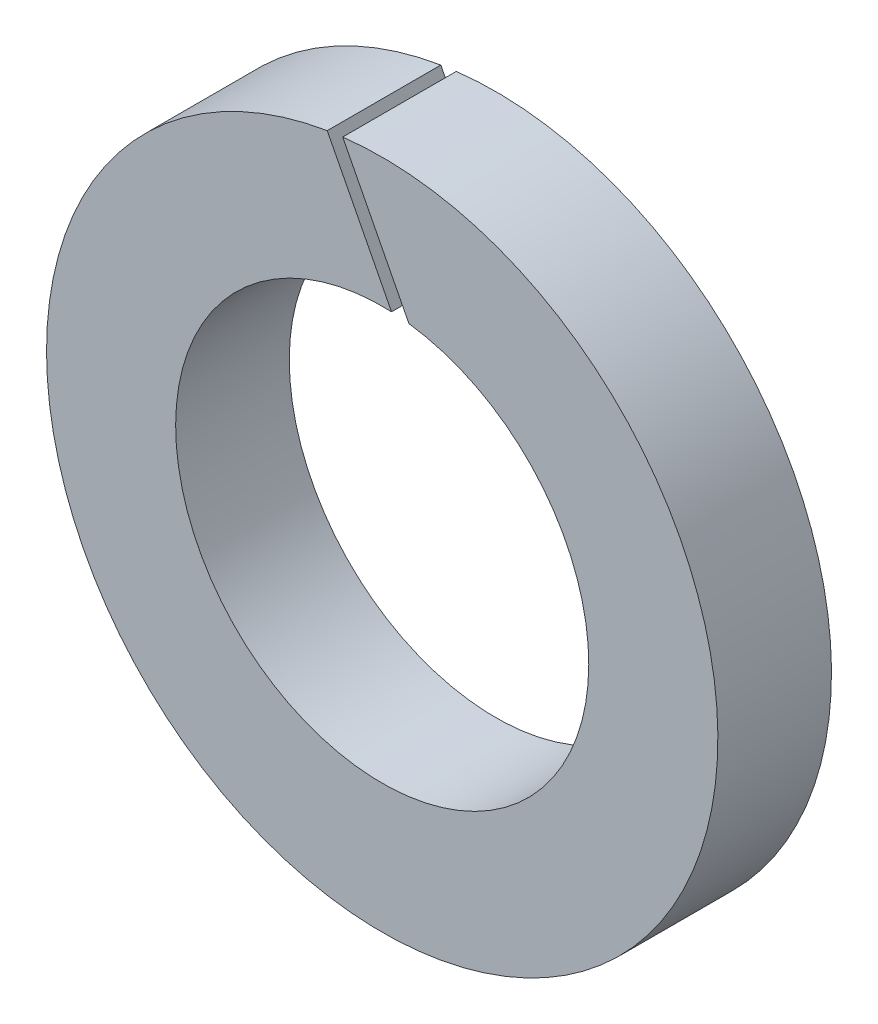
ISO-10303-21;
HEADER;
FILE_DESCRIPTION(('STEP AP214'),'2;1');
FILE_NAME('part.step','',(''),(''),'','','');
FILE_SCHEMA(('AUTOMOTIVE_DESIGN { 1 0 10303 214 1 1 1 1 }'));
ENDSEC;
DATA;
#1=APPLICATION_CONTEXT('core data for automotive mechanical design processes');
#2=APPLICATION_PROTOCOL_DEFINITION('international standard','automotive_design',2000,#1);
#3=PRODUCT_CONTEXT('',#1,'mechanical');
#4=PRODUCT('Part','Part','',(#3));
#5=PRODUCT_RELATED_PRODUCT_CATEGORY('part','',(#4));
#6=PRODUCT_DEFINITION_FORMATION('','',#4);
#7=PRODUCT_DEFINITION_CONTEXT('part definition',#1,'design');
#8=PRODUCT_DEFINITION('design','',#6,#7);
#9=PRODUCT_DEFINITION_SHAPE('','',#8);
#10=(LENGTH_UNIT() NAMED_UNIT(*) SI_UNIT(.MILLI.,.METRE.));
#11=(NAMED_UNIT(*) PLANE_ANGLE_UNIT() SI_UNIT($,.RADIAN.));
#12=(NAMED_UNIT(*) SI_UNIT($,.STERADIAN.) SOLID_ANGLE_UNIT());
#13=UNCERTAINTY_MEASURE_WITH_UNIT(LENGTH_MEASURE(1.E-05),#10,'distance_accuracy_value','');
#14=(GEOMETRIC_REPRESENTATION_CONTEXT(3) GLOBAL_UNCERTAINTY_ASSIGNED_CONTEXT((#13)) GLOBAL_UNIT_ASSIGNED_CONTEXT((#10,
#11,#12)) REPRESENTATION_CONTEXT('',''));
#15=CARTESIAN_POINT('',(0.,0.,0.));
#16=DIRECTION('',(0.,0.,1.));
#17=DIRECTION('',(1.,0.,0.));
#18=AXIS2_PLACEMENT_3D('',#15,#16,#17);
#19=CARTESIAN_POINT('',(0.,2.,0.));
#20=DIRECTION('',(0.,0.,1.));
#21=DIRECTION('',(1.,0.,0.));
#22=AXIS2_PLACEMENT_3D('',#19,#20,#21);
#23=PLANE('',#22);
#24=DIRECTION('',(-0.458120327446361,0.888890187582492,0.));
#25=VECTOR('',#24,1.);
#26=CARTESIAN_POINT('',(-0.474792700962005,3.40637624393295,0.));
#27=LINE('',#26,#25);
#28=CARTESIAN_POINT('',(0.258690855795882,1.9831991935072,0.));
#29=VERTEX_POINT('',#28);
#30=CARTESIAN_POINT('',(-0.382554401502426,3.22740640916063,0.));
#31=VERTEX_POINT('',#30);
#32=EDGE_CURVE('E405',#29,#31,#27,.T.);
#33=ORIENTED_EDGE('',*,*,#32,.F.);
#34=CARTESIAN_POINT('',(0.,0.,0.));
#35=DIRECTION('',(0.,0.,-1.));
#36=DIRECTION('',(-1.,0.,0.));
#37=AXIS2_PLACEMENT_3D('',#34,#35,#36);
#38=CIRCLE('',#37,2.);
#39=CARTESIAN_POINT('',(0.0902737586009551,1.99796162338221,0.));
#40=VERTEX_POINT('',#39);
#41=EDGE_CURVE('E404',#29,#40,#38,.T.);
#42=ORIENTED_EDGE('',*,*,#41,.T.);
#43=DIRECTION('',(0.458120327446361,-0.888890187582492,0.));
#44=VECTOR('',#43,1.);
#45=CARTESIAN_POINT('',(-0.601851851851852,3.34089191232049,0.));
#46=LINE('',#45,#44);
#47=CARTESIAN_POINT('',(-0.532381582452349,3.2060988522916,0.));
#48=VERTEX_POINT('',#47);
#49=EDGE_CURVE('E365',#48,#40,#46,.T.);
#50=ORIENTED_EDGE('',*,*,#49,.F.);
#51=CARTESIAN_POINT('',(0.,0.,0.));
#52=DIRECTION('',(0.,0.,-1.));
#53=DIRECTION('',(-1.,0.,0.));
#54=AXIS2_PLACEMENT_3D('',#51,#52,#53);
#55=CIRCLE('',#54,3.25);
#56=EDGE_CURVE('E402',#31,#48,#55,.T.);
#57=ORIENTED_EDGE('',*,*,#56,.F.);
#58=EDGE_LOOP('',(#33,#42,#50,#57));
#59=FACE_BOUND('',#58,.T.);
#60=ADVANCED_FACE('F351',(#59),#23,.T.);
#61=CARTESIAN_POINT('',(0.,0.,-4.46107408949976));
#62=DIRECTION('',(0.,0.,-1.));
#63=DIRECTION('',(-1.,0.,0.));
#64=AXIS2_PLACEMENT_3D('',#61,#62,#63);
#65=CYLINDRICAL_SURFACE('',#64,3.25);
#66=DIRECTION('',(0.,0.,-1.));
#67=VECTOR('',#66,1.);
#68=CARTESIAN_POINT('',(-0.382554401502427,3.22740640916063,-4.46107408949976));
#69=LINE('',#68,#67);
#70=CARTESIAN_POINT('',(-0.382554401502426,3.22740640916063,-1.1));
#71=VERTEX_POINT('',#70);
#72=EDGE_CURVE('E396',#31,#71,#69,.T.);
#73=ORIENTED_EDGE('',*,*,#72,.F.);
#74=ORIENTED_EDGE('',*,*,#56,.T.);
#75=DIRECTION('',(0.,0.,-1.));
#76=VECTOR('',#75,1.);
#77=CARTESIAN_POINT('',(-0.532381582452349,3.2060988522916,-4.46107408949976));
#78=LINE('',#77,#76);
#79=CARTESIAN_POINT('',(-0.532381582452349,3.2060988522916,-1.1));
#80=VERTEX_POINT('',#79);
#81=EDGE_CURVE('E388',#80,#48,#78,.F.);
#82=ORIENTED_EDGE('',*,*,#81,.F.);
#83=CARTESIAN_POINT('',(0.,0.,-1.1));
#84=DIRECTION('',(0.,0.,-1.));
#85=DIRECTION('',(-1.,0.,0.));
#86=AXIS2_PLACEMENT_3D('',#83,#84,#85);
#87=CIRCLE('',#86,3.25);
#88=EDGE_CURVE('E409',#71,#80,#87,.T.);
#89=ORIENTED_EDGE('',*,*,#88,.F.);
#90=EDGE_LOOP('',(#73,#74,#82,#89));
#91=FACE_BOUND('',#90,.T.);
#92=ADVANCED_FACE('F408',(#91),#65,.T.);
#93=CARTESIAN_POINT('',(0.,2.,-1.1));
#94=DIRECTION('',(0.,0.,-1.));
#95=DIRECTION('',(-1.,0.,0.));
#96=AXIS2_PLACEMENT_3D('',#93,#94,#95);
#97=PLANE('',#96);
#98=DIRECTION('',(-0.458120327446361,0.888890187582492,0.));
#99=VECTOR('',#98,1.);
#100=CARTESIAN_POINT('',(-0.474792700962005,3.40637624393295,-1.1));
#101=LINE('',#100,#99);
#102=CARTESIAN_POINT('',(0.258690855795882,1.9831991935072,-1.1));
#103=VERTEX_POINT('',#102);
#104=EDGE_CURVE('E372',#103,#71,#101,.T.);
#105=ORIENTED_EDGE('',*,*,#104,.T.);
#106=ORIENTED_EDGE('',*,*,#88,.T.);
#107=DIRECTION('',(0.458120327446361,-0.888890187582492,0.));
#108=VECTOR('',#107,1.);
#109=CARTESIAN_POINT('',(-0.601851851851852,3.34089191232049,-1.1));
#110=LINE('',#109,#108);
#111=CARTESIAN_POINT('',(0.0902737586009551,1.99796162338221,-1.1));
#112=VERTEX_POINT('',#111);
#113=EDGE_CURVE('E391',#80,#112,#110,.T.);
#114=ORIENTED_EDGE('',*,*,#113,.T.);
#115=CARTESIAN_POINT('',(0.,0.,-1.1));
#116=DIRECTION('',(0.,0.,-1.));
#117=DIRECTION('',(-1.,0.,0.));
#118=AXIS2_PLACEMENT_3D('',#115,#116,#117);
#119=CIRCLE('',#118,2.);
#120=EDGE_CURVE('E411',#103,#112,#119,.T.);
#121=ORIENTED_EDGE('',*,*,#120,.F.);
#122=EDGE_LOOP('',(#105,#106,#114,#121));
#123=FACE_BOUND('',#122,.T.);
#124=ADVANCED_FACE('F425',(#123),#97,.T.);
#125=CARTESIAN_POINT('',(0.,0.,-4.46107408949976));
#126=DIRECTION('',(0.,0.,-1.));
#127=DIRECTION('',(-1.,0.,0.));
#128=AXIS2_PLACEMENT_3D('',#125,#126,#127);
#129=CYLINDRICAL_SURFACE('',#128,2.);
#130=DIRECTION('',(0.,0.,-1.));
#131=VECTOR('',#130,1.);
#132=CARTESIAN_POINT('',(0.258690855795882,1.9831991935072,-4.46107408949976));
#133=LINE('',#132,#131);
#134=EDGE_CURVE('E11',#103,#29,#133,.F.);
#135=ORIENTED_EDGE('',*,*,#134,.F.);
#136=ORIENTED_EDGE('',*,*,#120,.T.);
#137=DIRECTION('',(0.,0.,-1.));
#138=VECTOR('',#137,1.);
#139=CARTESIAN_POINT('',(0.090273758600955,1.99796162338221,-4.46107408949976));
#140=LINE('',#139,#138);
#141=EDGE_CURVE('E358',#40,#112,#140,.T.);
#142=ORIENTED_EDGE('',*,*,#141,.F.);
#143=ORIENTED_EDGE('',*,*,#41,.F.);
#144=EDGE_LOOP('',(#135,#136,#142,#143));
#145=FACE_BOUND('',#144,.T.);
#146=ADVANCED_FACE('F422',(#145),#129,.F.);
#147=CARTESIAN_POINT('',(-0.601851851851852,3.34089191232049,-1.1));
#148=DIRECTION('',(-0.888890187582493,-0.458120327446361,0.));
#149=DIRECTION('',(0.458120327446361,-0.888890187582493,0.));
#150=AXIS2_PLACEMENT_3D('',#147,#148,#149);
#151=PLANE('',#150);
#152=ORIENTED_EDGE('',*,*,#81,.T.);
#153=ORIENTED_EDGE('',*,*,#49,.T.);
#154=ORIENTED_EDGE('',*,*,#141,.T.);
#155=ORIENTED_EDGE('',*,*,#113,.F.);
#156=EDGE_LOOP('',(#152,#153,#154,#155));
#157=FACE_BOUND('',#156,.T.);
#158=ADVANCED_FACE('F389',(#157),#151,.F.);
#159=CARTESIAN_POINT('',(-0.474792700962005,3.40637624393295,-1.1));
#160=DIRECTION('',(0.888890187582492,0.458120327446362,0.));
#161=DIRECTION('',(-0.458120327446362,0.888890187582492,0.));
#162=AXIS2_PLACEMENT_3D('',#159,#160,#161);
#163=PLANE('',#162);
#164=ORIENTED_EDGE('',*,*,#72,.T.);
#165=ORIENTED_EDGE('',*,*,#104,.F.);
#166=ORIENTED_EDGE('',*,*,#134,.T.);
#167=ORIENTED_EDGE('',*,*,#32,.T.);
#168=EDGE_LOOP('',(#164,#165,#166,#167));
#169=FACE_BOUND('',#168,.T.);
#170=ADVANCED_FACE('F420',(#169),#163,.F.);
#171=CLOSED_SHELL('',(#60,#92,#124,#146,#158,#170));
#172=MANIFOLD_SOLID_BREP('B2',#171);
#173=ADVANCED_BREP_SHAPE_REPRESENTATION('',(#18,#172),#14);
#174=SHAPE_DEFINITION_REPRESENTATION(#9,#173);
ENDSEC;
END-ISO-10303-21;
